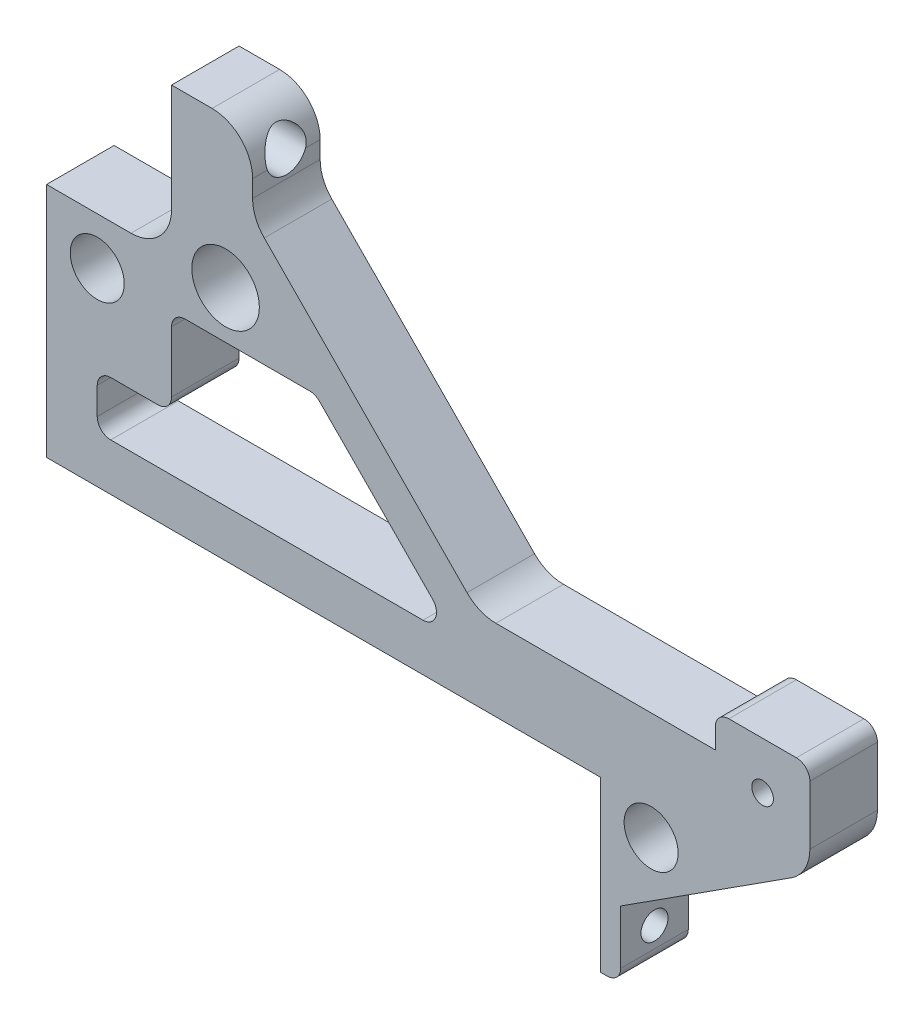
ISO-10303-21;
HEADER;
FILE_DESCRIPTION(('STEP AP214'),'2;1');
FILE_NAME('part.step','',(''),(''),'','','');
FILE_SCHEMA(('AUTOMOTIVE_DESIGN { 1 0 10303 214 1 1 1 1 }'));
ENDSEC;
DATA;
#1=APPLICATION_CONTEXT('core data for automotive mechanical design processes');
#2=APPLICATION_PROTOCOL_DEFINITION('international standard','automotive_design',2000,#1);
#3=PRODUCT_CONTEXT('',#1,'mechanical');
#4=PRODUCT('Part','Part','',(#3));
#5=PRODUCT_RELATED_PRODUCT_CATEGORY('part','',(#4));
#6=PRODUCT_DEFINITION_FORMATION('','',#4);
#7=PRODUCT_DEFINITION_CONTEXT('part definition',#1,'design');
#8=PRODUCT_DEFINITION('design','',#6,#7);
#9=PRODUCT_DEFINITION_SHAPE('','',#8);
#10=(LENGTH_UNIT() NAMED_UNIT(*) SI_UNIT(.MILLI.,.METRE.));
#11=(NAMED_UNIT(*) PLANE_ANGLE_UNIT() SI_UNIT($,.RADIAN.));
#12=(NAMED_UNIT(*) SI_UNIT($,.STERADIAN.) SOLID_ANGLE_UNIT());
#13=UNCERTAINTY_MEASURE_WITH_UNIT(LENGTH_MEASURE(1.E-05),#10,'distance_accuracy_value','');
#14=(GEOMETRIC_REPRESENTATION_CONTEXT(3) GLOBAL_UNCERTAINTY_ASSIGNED_CONTEXT((#13)) GLOBAL_UNIT_ASSIGNED_CONTEXT((#10,
#11,#12)) REPRESENTATION_CONTEXT('',''));
#15=CARTESIAN_POINT('',(0.,0.,0.));
#16=DIRECTION('',(0.,0.,1.));
#17=DIRECTION('',(1.,0.,0.));
#18=AXIS2_PLACEMENT_3D('',#15,#16,#17);
#19=CARTESIAN_POINT('',(-63.5,52.,0.));
#20=DIRECTION('',(-1.,0.,0.));
#21=DIRECTION('',(0.,0.,1.));
#22=AXIS2_PLACEMENT_3D('',#19,#20,#21);
#23=CYLINDRICAL_SURFACE('',#22,3.);
#24=CARTESIAN_POINT('',(-51.5,51.,2.82842712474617));
#25=CARTESIAN_POINT('',(-51.499981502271,51.0806790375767,2.85697161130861));
#26=CARTESIAN_POINT('',(-51.501626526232,51.1625947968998,2.88202984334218));
#27=CARTESIAN_POINT('',(-51.5084108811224,51.3281159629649,2.92503878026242));
#28=CARTESIAN_POINT('',(-51.513549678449,51.4117211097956,2.94299056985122));
#29=CARTESIAN_POINT('',(-51.5274524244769,51.5794243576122,2.97158571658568));
#30=CARTESIAN_POINT('',(-51.5361973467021,51.6635176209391,2.9822666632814));
#31=CARTESIAN_POINT('',(-51.5573379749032,51.8318414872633,2.99647380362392));
#32=CARTESIAN_POINT('',(-51.5697334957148,51.9160720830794,3.00000036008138));
#33=CARTESIAN_POINT('',(-51.5979519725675,52.0830111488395,2.99999964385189));
#34=CARTESIAN_POINT('',(-51.613736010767,52.1657261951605,2.99654900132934));
#35=CARTESIAN_POINT('',(-51.6486394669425,52.329904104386,2.98294517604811));
#36=CARTESIAN_POINT('',(-51.6677603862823,52.4113663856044,2.97278897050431));
#37=CARTESIAN_POINT('',(-51.7297925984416,52.6529462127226,2.93261847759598));
#38=CARTESIAN_POINT('',(-51.7773911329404,52.8103605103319,2.89290176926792));
#39=CARTESIAN_POINT('',(-51.8820551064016,53.1128830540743,2.79050690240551));
#40=CARTESIAN_POINT('',(-51.9390677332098,53.2580534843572,2.72795460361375));
#41=CARTESIAN_POINT('',(-52.0596441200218,53.5348223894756,2.58239796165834));
#42=CARTESIAN_POINT('',(-52.1232118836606,53.6664124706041,2.49938107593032));
#43=CARTESIAN_POINT('',(-52.2602565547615,53.9272868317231,2.30536574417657));
#44=CARTESIAN_POINT('',(-52.3340742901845,54.054888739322,2.19234821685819));
#45=CARTESIAN_POINT('',(-52.4803080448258,54.2896516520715,1.94588435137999));
#46=CARTESIAN_POINT('',(-52.5527237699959,54.3968084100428,1.81243377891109));
#47=CARTESIAN_POINT('',(-52.6810338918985,54.576048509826,1.5448240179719));
#48=CARTESIAN_POINT('',(-52.7378562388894,54.650866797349,1.41294750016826));
#49=CARTESIAN_POINT('',(-52.8403806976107,54.7808477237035,1.13587136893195));
#50=CARTESIAN_POINT('',(-52.8861013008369,54.8360431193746,0.990694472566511));
#51=CARTESIAN_POINT('',(-52.9537303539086,54.9158223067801,0.717192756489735));
#52=CARTESIAN_POINT('',(-52.9784718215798,54.9441691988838,0.590679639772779));
#53=CARTESIAN_POINT('',(-53.0137741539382,54.9842838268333,0.333141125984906));
#54=CARTESIAN_POINT('',(-53.0243492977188,54.9960682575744,0.202120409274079));
#55=CARTESIAN_POINT('',(-53.0298940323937,55.0022714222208,-0.0609780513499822));
#56=CARTESIAN_POINT('',(-53.0248276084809,54.9966500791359,-0.193057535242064));
#57=CARTESIAN_POINT('',(-52.9997314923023,54.9683647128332,-0.453934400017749));
#58=CARTESIAN_POINT('',(-52.9796923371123,54.94568991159,-0.582729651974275));
#59=CARTESIAN_POINT('',(-52.9276862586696,54.8852894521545,-0.831372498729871));
#60=CARTESIAN_POINT('',(-52.8959567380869,54.8478623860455,-0.951344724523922));
#61=CARTESIAN_POINT('',(-52.823566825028,54.7595522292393,-1.18334526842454));
#62=CARTESIAN_POINT('',(-52.7829001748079,54.7086597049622,-1.29536794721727));
#63=CARTESIAN_POINT('',(-52.6749902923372,54.5679639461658,-1.56129787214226));
#64=CARTESIAN_POINT('',(-52.604250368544,54.4711233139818,-1.71008506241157));
#65=CARTESIAN_POINT('',(-52.4575964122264,54.2544332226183,-1.98709164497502));
#66=CARTESIAN_POINT('',(-52.381673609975,54.134544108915,-2.11527488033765));
#67=CARTESIAN_POINT('',(-52.230274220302,53.8728159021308,-2.35026741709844));
#68=CARTESIAN_POINT('',(-52.1548075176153,53.7307920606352,-2.45687766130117));
#69=CARTESIAN_POINT('',(-52.0105056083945,53.4276534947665,-2.6445164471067));
#70=CARTESIAN_POINT('',(-51.9416646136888,53.266555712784,-2.72556746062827));
#71=CARTESIAN_POINT('',(-51.8468058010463,53.0123977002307,-2.82550388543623));
#72=CARTESIAN_POINT('',(-51.816452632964,52.9251114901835,-2.85530577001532));
#73=CARTESIAN_POINT('',(-51.7592452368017,52.7471250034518,-2.90695291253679));
#74=CARTESIAN_POINT('',(-51.7323890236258,52.6564267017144,-2.92880269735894));
#75=CARTESIAN_POINT('',(-51.6826828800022,52.4723815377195,-2.9640567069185));
#76=CARTESIAN_POINT('',(-51.6598307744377,52.3790361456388,-2.97746552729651));
#77=CARTESIAN_POINT('',(-51.6185212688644,52.1905881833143,-2.99543394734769));
#78=CARTESIAN_POINT('',(-51.600060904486,52.0954868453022,-2.99999953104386));
#79=CARTESIAN_POINT('',(-51.5697329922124,51.9160696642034,-3.00000041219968));
#80=CARTESIAN_POINT('',(-51.5573379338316,51.8318414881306,-2.99647384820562));
#81=CARTESIAN_POINT('',(-51.5361991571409,51.6635317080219,-2.98226780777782));
#82=CARTESIAN_POINT('',(-51.5274551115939,51.5794500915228,-2.97158897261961));
#83=CARTESIAN_POINT('',(-51.513552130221,51.4117573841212,-2.94299789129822));
#84=CARTESIAN_POINT('',(-51.5084127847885,51.3281512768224,-2.9250469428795));
#85=CARTESIAN_POINT('',(-51.501626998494,51.1626175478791,-2.8820367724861));
#86=CARTESIAN_POINT('',(-51.4999815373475,51.0806904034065,-2.85697555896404));
#87=CARTESIAN_POINT('',(-51.5,51.,-2.82842712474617));
#88=B_SPLINE_CURVE_WITH_KNOTS('',3,(#24,#25,#26,#27,#28,#29,#30,#31,#32,#33,#34,#35,#36,#37,#38,
#39,#40,#41,#42,#43,#44,#45,#46,#47,#48,#49,#50,#51,#52,#53,#54,#55,#56,#57,#58,#59,#60,#61,#62,
#63,#64,#65,#66,#67,#68,#69,#70,#71,#72,#73,#74,#75,#76,#77,#78,#79,#80,#81,#82,#83,#84,#85,#86,
#87),.UNSPECIFIED.,.F.,.F.,(4,2,2,2,2,2,2,2,2,2,2,2,2,2,2,2,2,2,2,2,2,2,2,2,2,2,2,2,2,2,2,4),
(0.,0.256649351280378,0.513259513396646,0.768532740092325,1.02379302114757,1.27626502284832,
1.52885091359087,2.03371129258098,2.53583010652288,3.03825743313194,3.593262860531,
4.14838345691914,4.63236089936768,5.11552659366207,5.50982447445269,5.90372461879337,
6.29853239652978,6.6935899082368,7.08103113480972,7.46874451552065,8.0390493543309,
8.61034431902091,9.18669181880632,9.76253116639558,10.0534583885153,10.3442197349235,
10.6348226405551,10.9252288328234,11.1804879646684,11.4357242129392,11.6923370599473,
11.9490218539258),.UNSPECIFIED.);
#89=CARTESIAN_POINT('',(-51.5,51.,2.82842712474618));
#90=VERTEX_POINT('',#89);
#91=CARTESIAN_POINT('',(-51.5,51.,-2.82842712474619));
#92=VERTEX_POINT('',#91);
#93=EDGE_CURVE('E477',#90,#92,#88,.T.);
#94=ORIENTED_EDGE('',*,*,#93,.F.);
#95=CARTESIAN_POINT('',(-51.5,52.,0.));
#96=DIRECTION('',(-1.,0.,0.));
#97=DIRECTION('',(0.,0.,1.));
#98=AXIS2_PLACEMENT_3D('',#95,#96,#97);
#99=CIRCLE('',#98,3.);
#100=EDGE_CURVE('E481',#92,#90,#99,.T.);
#101=ORIENTED_EDGE('',*,*,#100,.F.);
#102=EDGE_LOOP('',(#94,#101));
#103=FACE_BOUND('',#102,.T.);
#104=CARTESIAN_POINT('',(-63.5,52.,0.));
#105=DIRECTION('',(-1.,0.,0.));
#106=DIRECTION('',(0.,0.,1.));
#107=AXIS2_PLACEMENT_3D('',#104,#105,#106);
#108=CIRCLE('',#107,3.);
#109=CARTESIAN_POINT('',(-63.5,52.,3.));
#110=VERTEX_POINT('',#109);
#111=EDGE_CURVE('E472',#110,#110,#108,.F.);
#112=ORIENTED_EDGE('',*,*,#111,.F.);
#113=EDGE_LOOP('',(#112));
#114=FACE_BOUND('',#113,.T.);
#115=ADVANCED_FACE('F16',(#103,#114),#23,.F.);
#116=CARTESIAN_POINT('',(0.,-25.,-5.));
#117=DIRECTION('',(0.,-1.,0.));
#118=DIRECTION('',(0.,0.,-1.));
#119=AXIS2_PLACEMENT_3D('',#116,#117,#118);
#120=PLANE('',#119);
#121=DIRECTION('',(1.,0.,0.));
#122=VECTOR('',#121,1.);
#123=CARTESIAN_POINT('',(0.,-25.,-5.));
#124=LINE('',#123,#122);
#125=CARTESIAN_POINT('',(0.,-25.,-5.));
#126=VERTEX_POINT('',#125);
#127=CARTESIAN_POINT('',(1.,-25.,-5.));
#128=VERTEX_POINT('',#127);
#129=EDGE_CURVE('E229',#126,#128,#124,.T.);
#130=ORIENTED_EDGE('',*,*,#129,.T.);
#131=DIRECTION('',(0.,0.,-1.));
#132=VECTOR('',#131,1.);
#133=CARTESIAN_POINT('',(1.,-25.,18.036));
#134=LINE('',#133,#132);
#135=CARTESIAN_POINT('',(1.,-25.,5.));
#136=VERTEX_POINT('',#135);
#137=EDGE_CURVE('E383',#136,#128,#134,.T.);
#138=ORIENTED_EDGE('',*,*,#137,.F.);
#139=DIRECTION('',(1.,0.,0.));
#140=VECTOR('',#139,1.);
#141=CARTESIAN_POINT('',(0.,-25.,5.));
#142=LINE('',#141,#140);
#143=CARTESIAN_POINT('',(0.,-25.,5.));
#144=VERTEX_POINT('',#143);
#145=EDGE_CURVE('E230',#136,#144,#142,.F.);
#146=ORIENTED_EDGE('',*,*,#145,.T.);
#147=DIRECTION('',(0.,0.,1.));
#148=VECTOR('',#147,1.);
#149=CARTESIAN_POINT('',(0.,-25.,-5.));
#150=LINE('',#149,#148);
#151=EDGE_CURVE('E488',#126,#144,#150,.T.);
#152=ORIENTED_EDGE('',*,*,#151,.F.);
#153=EDGE_LOOP('',(#130,#138,#146,#152));
#154=FACE_BOUND('',#153,.T.);
#155=ADVANCED_FACE('F844',(#154),#120,.T.);
#156=CARTESIAN_POINT('',(0.,-20.,0.));
#157=DIRECTION('',(1.,0.,0.));
#158=DIRECTION('',(0.,0.,-1.));
#159=AXIS2_PLACEMENT_3D('',#156,#157,#158);
#160=CYLINDRICAL_SURFACE('',#159,2.);
#161=CARTESIAN_POINT('',(3.,-20.,0.));
#162=DIRECTION('',(1.,0.,0.));
#163=DIRECTION('',(0.,0.,-1.));
#164=AXIS2_PLACEMENT_3D('',#161,#162,#163);
#165=CIRCLE('',#164,2.);
#166=CARTESIAN_POINT('',(3.,-20.,-2.));
#167=VERTEX_POINT('',#166);
#168=EDGE_CURVE('E376',#167,#167,#165,.F.);
#169=ORIENTED_EDGE('',*,*,#168,.F.);
#170=EDGE_LOOP('',(#169));
#171=FACE_BOUND('',#170,.T.);
#172=CARTESIAN_POINT('',(0.,-20.,0.));
#173=DIRECTION('',(1.,0.,0.));
#174=DIRECTION('',(0.,0.,-1.));
#175=AXIS2_PLACEMENT_3D('',#172,#173,#174);
#176=CIRCLE('',#175,2.);
#177=CARTESIAN_POINT('',(0.,-20.,-2.));
#178=VERTEX_POINT('',#177);
#179=EDGE_CURVE('E387',#178,#178,#176,.T.);
#180=ORIENTED_EDGE('',*,*,#179,.F.);
#181=EDGE_LOOP('',(#180));
#182=FACE_BOUND('',#181,.T.);
#183=ADVANCED_FACE('F846',(#171,#182),#160,.F.);
#184=CARTESIAN_POINT('',(-43.02494521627,26.,18.036));
#185=DIRECTION('',(0.,0.,-1.));
#186=DIRECTION('',(-1.,0.,0.));
#187=AXIS2_PLACEMENT_3D('',#184,#185,#186);
#188=CYLINDRICAL_SURFACE('',#187,2.);
#189=DIRECTION('',(0.,0.,1.));
#190=VECTOR('',#189,1.);
#191=CARTESIAN_POINT('',(-41.6002950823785,27.4036993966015,-6.));
#192=LINE('',#191,#190);
#193=CARTESIAN_POINT('',(-41.6002950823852,27.4036993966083,-5.));
#194=VERTEX_POINT('',#193);
#195=CARTESIAN_POINT('',(-41.600295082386,27.4036993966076,5.));
#196=VERTEX_POINT('',#195);
#197=EDGE_CURVE('E232',#194,#196,#192,.T.);
#198=ORIENTED_EDGE('',*,*,#197,.T.);
#199=CARTESIAN_POINT('',(-43.02494521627,26.,5.));
#200=DIRECTION('',(0.,0.,-1.));
#201=DIRECTION('',(-1.,0.,0.));
#202=AXIS2_PLACEMENT_3D('',#199,#200,#201);
#203=CIRCLE('',#202,2.);
#204=CARTESIAN_POINT('',(-43.02494521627,28.,5.));
#205=VERTEX_POINT('',#204);
#206=EDGE_CURVE('E20',#205,#196,#203,.T.);
#207=ORIENTED_EDGE('',*,*,#206,.F.);
#208=DIRECTION('',(0.,0.,1.));
#209=VECTOR('',#208,1.);
#210=CARTESIAN_POINT('',(-43.02494521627,28.,-6.));
#211=LINE('',#210,#209);
#212=CARTESIAN_POINT('',(-43.02494521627,28.,-5.));
#213=VERTEX_POINT('',#212);
#214=EDGE_CURVE('E343',#205,#213,#211,.F.);
#215=ORIENTED_EDGE('',*,*,#214,.T.);
#216=CARTESIAN_POINT('',(-43.02494521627,26.,-5.));
#217=DIRECTION('',(0.,0.,-1.));
#218=DIRECTION('',(-1.,0.,0.));
#219=AXIS2_PLACEMENT_3D('',#216,#217,#218);
#220=CIRCLE('',#219,2.);
#221=EDGE_CURVE('E235',#213,#194,#220,.T.);
#222=ORIENTED_EDGE('',*,*,#221,.T.);
#223=EDGE_LOOP('',(#198,#207,#215,#222));
#224=FACE_BOUND('',#223,.T.);
#225=ADVANCED_FACE('F233',(#224),#188,.F.);
#226=CARTESIAN_POINT('',(0.,0.,-5.));
#227=DIRECTION('',(0.,0.,1.));
#228=DIRECTION('',(1.,0.,0.));
#229=AXIS2_PLACEMENT_3D('',#226,#227,#228);
#230=PLANE('',#229);
#231=CARTESIAN_POINT('',(24.,10.,-5.));
#232=DIRECTION('',(0.,0.,1.));
#233=DIRECTION('',(1.,0.,0.));
#234=AXIS2_PLACEMENT_3D('',#231,#232,#233);
#235=CIRCLE('',#234,1.6);
#236=CARTESIAN_POINT('',(25.6,10.,-5.));
#237=VERTEX_POINT('',#236);
#238=EDGE_CURVE('E315',#237,#237,#235,.T.);
#239=ORIENTED_EDGE('',*,*,#238,.T.);
#240=EDGE_LOOP('',(#239));
#241=FACE_BOUND('',#240,.T.);
#242=CARTESIAN_POINT('',(-55.5,35.,-5.));
#243=DIRECTION('',(0.,0.,1.));
#244=DIRECTION('',(1.,0.,0.));
#245=AXIS2_PLACEMENT_3D('',#242,#243,#244);
#246=CIRCLE('',#245,5.);
#247=CARTESIAN_POINT('',(-50.5,35.,-5.));
#248=VERTEX_POINT('',#247);
#249=EDGE_CURVE('E542',#248,#248,#246,.T.);
#250=ORIENTED_EDGE('',*,*,#249,.T.);
#251=EDGE_LOOP('',(#250));
#252=FACE_BOUND('',#251,.T.);
#253=CARTESIAN_POINT('',(-74.5,28.,-5.));
#254=DIRECTION('',(0.,0.,1.));
#255=DIRECTION('',(1.,0.,0.));
#256=AXIS2_PLACEMENT_3D('',#253,#254,#255);
#257=CIRCLE('',#256,4.);
#258=CARTESIAN_POINT('',(-70.5,28.,-5.));
#259=VERTEX_POINT('',#258);
#260=EDGE_CURVE('E545',#259,#259,#257,.T.);
#261=ORIENTED_EDGE('',*,*,#260,.T.);
#262=EDGE_LOOP('',(#261));
#263=FACE_BOUND('',#262,.T.);
#264=CARTESIAN_POINT('',(7.5,-4.,-5.));
#265=DIRECTION('',(0.,0.,1.));
#266=DIRECTION('',(1.,0.,0.));
#267=AXIS2_PLACEMENT_3D('',#264,#265,#266);
#268=CIRCLE('',#267,4.);
#269=CARTESIAN_POINT('',(11.5,-4.,-5.));
#270=VERTEX_POINT('',#269);
#271=EDGE_CURVE('E321',#270,#270,#268,.T.);
#272=ORIENTED_EDGE('',*,*,#271,.T.);
#273=EDGE_LOOP('',(#272));
#274=FACE_BOUND('',#273,.T.);
#275=CARTESIAN_POINT('',(-72.5,13.,-5.));
#276=DIRECTION('',(0.,0.,-1.));
#277=DIRECTION('',(-1.,0.,0.));
#278=AXIS2_PLACEMENT_3D('',#275,#276,#277);
#279=CIRCLE('',#278,2.);
#280=CARTESIAN_POINT('',(-72.5,15.,-5.));
#281=VERTEX_POINT('',#280);
#282=CARTESIAN_POINT('',(-74.5,13.,-5.));
#283=VERTEX_POINT('',#282);
#284=EDGE_CURVE('E329',#281,#283,#279,.F.);
#285=ORIENTED_EDGE('',*,*,#284,.T.);
#286=DIRECTION('',(0.,1.,0.));
#287=VECTOR('',#286,1.);
#288=CARTESIAN_POINT('',(-74.5,15.,-5.));
#289=LINE('',#288,#287);
#290=CARTESIAN_POINT('',(-74.5,9.,-5.));
#291=VERTEX_POINT('',#290);
#292=EDGE_CURVE('E332',#283,#291,#289,.F.);
#293=ORIENTED_EDGE('',*,*,#292,.T.);
#294=CARTESIAN_POINT('',(-72.5,9.,-5.));
#295=DIRECTION('',(0.,0.,-1.));
#296=DIRECTION('',(-1.,0.,0.));
#297=AXIS2_PLACEMENT_3D('',#294,#295,#296);
#298=CIRCLE('',#297,2.);
#299=CARTESIAN_POINT('',(-72.5,7.,-5.));
#300=VERTEX_POINT('',#299);
#301=EDGE_CURVE('E335',#291,#300,#298,.F.);
#302=ORIENTED_EDGE('',*,*,#301,.T.);
#303=DIRECTION('',(1.,0.,0.));
#304=VECTOR('',#303,1.);
#305=CARTESIAN_POINT('',(-74.5,7.,-5.));
#306=LINE('',#305,#304);
#307=CARTESIAN_POINT('',(-26.27494521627,7.,-5.));
#308=VERTEX_POINT('',#307);
#309=EDGE_CURVE('E336',#300,#308,#306,.T.);
#310=ORIENTED_EDGE('',*,*,#309,.T.);
#311=CARTESIAN_POINT('',(-26.27494521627,9.,-5.));
#312=DIRECTION('',(0.,0.,-1.));
#313=DIRECTION('',(-1.,0.,0.));
#314=AXIS2_PLACEMENT_3D('',#311,#312,#313);
#315=CIRCLE('',#314,2.);
#316=CARTESIAN_POINT('',(-24.850295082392,10.4036993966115,-5.));
#317=VERTEX_POINT('',#316);
#318=EDGE_CURVE('E339',#308,#317,#315,.F.);
#319=ORIENTED_EDGE('',*,*,#318,.T.);
#320=DIRECTION('',(-0.701849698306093,0.712325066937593,0.));
#321=VECTOR('',#320,1.);
#322=CARTESIAN_POINT('',(-21.49665008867,7.,-5.));
#323=LINE('',#322,#321);
#324=EDGE_CURVE('E238',#317,#194,#323,.T.);
#325=ORIENTED_EDGE('',*,*,#324,.T.);
#326=ORIENTED_EDGE('',*,*,#221,.F.);
#327=DIRECTION('',(1.,0.,0.));
#328=VECTOR('',#327,1.);
#329=CARTESIAN_POINT('',(-42.18782655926,28.,-5.));
#330=LINE('',#329,#328);
#331=CARTESIAN_POINT('',(-61.5,28.,-5.));
#332=VERTEX_POINT('',#331);
#333=EDGE_CURVE('E239',#213,#332,#330,.F.);
#334=ORIENTED_EDGE('',*,*,#333,.T.);
#335=CARTESIAN_POINT('',(-61.5,26.,-5.));
#336=DIRECTION('',(0.,0.,-1.));
#337=DIRECTION('',(-1.,0.,0.));
#338=AXIS2_PLACEMENT_3D('',#335,#336,#337);
#339=CIRCLE('',#338,2.);
#340=CARTESIAN_POINT('',(-63.5,26.,-5.));
#341=VERTEX_POINT('',#340);
#342=EDGE_CURVE('E344',#332,#341,#339,.F.);
#343=ORIENTED_EDGE('',*,*,#342,.T.);
#344=DIRECTION('',(0.,1.,0.));
#345=VECTOR('',#344,1.);
#346=CARTESIAN_POINT('',(-63.5,28.,-5.));
#347=LINE('',#346,#345);
#348=CARTESIAN_POINT('',(-63.5,17.,-5.));
#349=VERTEX_POINT('',#348);
#350=EDGE_CURVE('E348',#341,#349,#347,.F.);
#351=ORIENTED_EDGE('',*,*,#350,.T.);
#352=CARTESIAN_POINT('',(-65.5,17.,-5.));
#353=DIRECTION('',(0.,0.,1.));
#354=DIRECTION('',(1.,0.,0.));
#355=AXIS2_PLACEMENT_3D('',#352,#353,#354);
#356=CIRCLE('',#355,2.);
#357=CARTESIAN_POINT('',(-65.5,15.,-5.));
#358=VERTEX_POINT('',#357);
#359=EDGE_CURVE('E322',#358,#349,#356,.T.);
#360=ORIENTED_EDGE('',*,*,#359,.F.);
#361=DIRECTION('',(1.,0.,0.));
#362=VECTOR('',#361,1.);
#363=CARTESIAN_POINT('',(-63.5,15.,-5.));
#364=LINE('',#363,#362);
#365=EDGE_CURVE('E326',#358,#281,#364,.F.);
#366=ORIENTED_EDGE('',*,*,#365,.T.);
#367=EDGE_LOOP('',(#285,#293,#302,#310,#319,#325,#326,#334,#343,#351,#360,#366));
#368=FACE_BOUND('',#367,.T.);
#369=CARTESIAN_POINT('',(29.,15.,-5.));
#370=DIRECTION('',(0.,0.,-1.));
#371=DIRECTION('',(-1.,0.,0.));
#372=AXIS2_PLACEMENT_3D('',#369,#370,#371);
#373=CIRCLE('',#372,2.);
#374=CARTESIAN_POINT('',(31.,15.,-5.));
#375=VERTEX_POINT('',#374);
#376=CARTESIAN_POINT('',(29.,17.,-5.));
#377=VERTEX_POINT('',#376);
#378=EDGE_CURVE('E360',#375,#377,#373,.F.);
#379=ORIENTED_EDGE('',*,*,#378,.F.);
#380=DIRECTION('',(0.,1.,0.));
#381=VECTOR('',#380,1.);
#382=CARTESIAN_POINT('',(31.,3.,-5.));
#383=LINE('',#382,#381);
#384=CARTESIAN_POINT('',(31.,6.275707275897,-5.));
#385=VERTEX_POINT('',#384);
#386=EDGE_CURVE('E364',#385,#375,#383,.T.);
#387=ORIENTED_EDGE('',*,*,#386,.F.);
#388=CARTESIAN_POINT('',(25.,6.275707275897,-5.));
#389=DIRECTION('',(0.,0.,-1.));
#390=DIRECTION('',(-1.,0.,0.));
#391=AXIS2_PLACEMENT_3D('',#388,#389,#390);
#392=CIRCLE('',#391,6.);
#393=CARTESIAN_POINT('',(28.2445455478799,1.22863642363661,-5.));
#394=VERTEX_POINT('',#393);
#395=EDGE_CURVE('E368',#394,#385,#392,.F.);
#396=ORIENTED_EDGE('',*,*,#395,.F.);
#397=DIRECTION('',(0.841178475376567,0.540757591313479,0.));
#398=VECTOR('',#397,1.);
#399=CARTESIAN_POINT('',(3.,-15.,-5.));
#400=LINE('',#399,#398);
#401=CARTESIAN_POINT('',(3.,-15.,-5.));
#402=VERTEX_POINT('',#401);
#403=EDGE_CURVE('E372',#402,#394,#400,.T.);
#404=ORIENTED_EDGE('',*,*,#403,.F.);
#405=DIRECTION('',(0.,1.,0.));
#406=VECTOR('',#405,1.);
#407=CARTESIAN_POINT('',(3.,-25.,-5.));
#408=LINE('',#407,#406);
#409=CARTESIAN_POINT('',(3.,-23.,-5.));
#410=VERTEX_POINT('',#409);
#411=EDGE_CURVE('E382',#410,#402,#408,.T.);
#412=ORIENTED_EDGE('',*,*,#411,.F.);
#413=CARTESIAN_POINT('',(1.,-23.,-5.));
#414=DIRECTION('',(0.,0.,-1.));
#415=DIRECTION('',(-1.,0.,0.));
#416=AXIS2_PLACEMENT_3D('',#413,#414,#415);
#417=CIRCLE('',#416,2.);
#418=EDGE_CURVE('E386',#128,#410,#417,.F.);
#419=ORIENTED_EDGE('',*,*,#418,.F.);
#420=ORIENTED_EDGE('',*,*,#129,.F.);
#421=DIRECTION('',(0.,1.,0.));
#422=VECTOR('',#421,1.);
#423=CARTESIAN_POINT('',(0.,0.,-5.));
#424=LINE('',#423,#422);
#425=CARTESIAN_POINT('',(0.,0.,-5.));
#426=VERTEX_POINT('',#425);
#427=EDGE_CURVE('E495',#426,#126,#424,.F.);
#428=ORIENTED_EDGE('',*,*,#427,.F.);
#429=DIRECTION('',(1.,0.,0.));
#430=VECTOR('',#429,1.);
#431=CARTESIAN_POINT('',(-82.,0.,-5.));
#432=LINE('',#431,#430);
#433=CARTESIAN_POINT('',(-82.,0.,-5.));
#434=VERTEX_POINT('',#433);
#435=EDGE_CURVE('E492',#434,#426,#432,.T.);
#436=ORIENTED_EDGE('',*,*,#435,.F.);
#437=DIRECTION('',(0.,1.,0.));
#438=VECTOR('',#437,1.);
#439=CARTESIAN_POINT('',(-82.,35.,-5.));
#440=LINE('',#439,#438);
#441=CARTESIAN_POINT('',(-82.,35.,-5.));
#442=VERTEX_POINT('',#441);
#443=EDGE_CURVE('E399',#442,#434,#440,.F.);
#444=ORIENTED_EDGE('',*,*,#443,.F.);
#445=DIRECTION('',(1.,0.,0.));
#446=VECTOR('',#445,1.);
#447=CARTESIAN_POINT('',(-63.5,35.,-5.));
#448=LINE('',#447,#446);
#449=CARTESIAN_POINT('',(-69.5,35.,-5.));
#450=VERTEX_POINT('',#449);
#451=EDGE_CURVE('E392',#450,#442,#448,.F.);
#452=ORIENTED_EDGE('',*,*,#451,.F.);
#453=CARTESIAN_POINT('',(-69.5,41.,-5.));
#454=DIRECTION('',(0.,0.,1.));
#455=DIRECTION('',(1.,0.,0.));
#456=AXIS2_PLACEMENT_3D('',#453,#454,#455);
#457=CIRCLE('',#456,6.);
#458=CARTESIAN_POINT('',(-63.5,41.,-5.));
#459=VERTEX_POINT('',#458);
#460=EDGE_CURVE('E404',#450,#459,#457,.T.);
#461=ORIENTED_EDGE('',*,*,#460,.T.);
#462=DIRECTION('',(0.,1.,0.));
#463=VECTOR('',#462,1.);
#464=CARTESIAN_POINT('',(-63.5,57.,-5.));
#465=LINE('',#464,#463);
#466=CARTESIAN_POINT('',(-63.5,57.,-5.));
#467=VERTEX_POINT('',#466);
#468=EDGE_CURVE('E408',#467,#459,#465,.F.);
#469=ORIENTED_EDGE('',*,*,#468,.F.);
#470=DIRECTION('',(1.,0.,0.));
#471=VECTOR('',#470,1.);
#472=CARTESIAN_POINT('',(-51.5,57.,-5.));
#473=LINE('',#472,#471);
#474=CARTESIAN_POINT('',(-57.5,57.,-5.));
#475=VERTEX_POINT('',#474);
#476=EDGE_CURVE('E414',#475,#467,#473,.F.);
#477=ORIENTED_EDGE('',*,*,#476,.F.);
#478=CARTESIAN_POINT('',(-57.5,51.,-5.));
#479=DIRECTION('',(0.,0.,-1.));
#480=DIRECTION('',(-1.,0.,0.));
#481=AXIS2_PLACEMENT_3D('',#478,#479,#480);
#482=CIRCLE('',#481,6.);
#483=CARTESIAN_POINT('',(-51.5,51.,-5.));
#484=VERTEX_POINT('',#483);
#485=EDGE_CURVE('E580',#484,#475,#482,.F.);
#486=ORIENTED_EDGE('',*,*,#485,.F.);
#487=DIRECTION('',(0.,1.,0.));
#488=VECTOR('',#487,1.);
#489=CARTESIAN_POINT('',(-51.5,46.,-5.));
#490=LINE('',#489,#488);
#491=CARTESIAN_POINT('',(-51.5,48.45928665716,-5.));
#492=VERTEX_POINT('',#491);
#493=EDGE_CURVE('E418',#492,#484,#490,.T.);
#494=ORIENTED_EDGE('',*,*,#493,.F.);
#495=CARTESIAN_POINT('',(-45.5,48.45928665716,-5.));
#496=DIRECTION('',(0.,0.,1.));
#497=DIRECTION('',(1.,0.,0.));
#498=AXIS2_PLACEMENT_3D('',#495,#496,#497);
#499=CIRCLE('',#498,6.);
#500=CARTESIAN_POINT('',(-49.7739504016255,44.2481884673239,-5.));
#501=VERTEX_POINT('',#500);
#502=EDGE_CURVE('E421',#492,#501,#499,.T.);
#503=ORIENTED_EDGE('',*,*,#502,.T.);
#504=DIRECTION('',(-0.701849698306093,0.712325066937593,0.));
#505=VECTOR('',#504,1.);
#506=CARTESIAN_POINT('',(-18.,12.,-5.));
#507=LINE('',#506,#505);
#508=CARTESIAN_POINT('',(-19.7625944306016,13.7889018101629,-5.));
#509=VERTEX_POINT('',#508);
#510=EDGE_CURVE('E425',#509,#501,#507,.T.);
#511=ORIENTED_EDGE('',*,*,#510,.F.);
#512=CARTESIAN_POINT('',(-15.48864402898,18.,-5.));
#513=DIRECTION('',(0.,0.,1.));
#514=DIRECTION('',(1.,0.,0.));
#515=AXIS2_PLACEMENT_3D('',#512,#513,#514);
#516=CIRCLE('',#515,6.);
#517=CARTESIAN_POINT('',(-15.48864402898,12.,-5.));
#518=VERTEX_POINT('',#517);
#519=EDGE_CURVE('E428',#509,#518,#516,.T.);
#520=ORIENTED_EDGE('',*,*,#519,.T.);
#521=DIRECTION('',(1.,0.,0.));
#522=VECTOR('',#521,1.);
#523=CARTESIAN_POINT('',(17.,12.,-5.));
#524=LINE('',#523,#522);
#525=CARTESIAN_POINT('',(17.,12.,-5.));
#526=VERTEX_POINT('',#525);
#527=EDGE_CURVE('E432',#526,#518,#524,.F.);
#528=ORIENTED_EDGE('',*,*,#527,.F.);
#529=DIRECTION('',(0.,1.,0.));
#530=VECTOR('',#529,1.);
#531=CARTESIAN_POINT('',(17.,17.,-5.));
#532=LINE('',#531,#530);
#533=CARTESIAN_POINT('',(17.,15.,-5.));
#534=VERTEX_POINT('',#533);
#535=EDGE_CURVE('E433',#534,#526,#532,.F.);
#536=ORIENTED_EDGE('',*,*,#535,.F.);
#537=CARTESIAN_POINT('',(19.,15.,-5.));
#538=DIRECTION('',(0.,0.,-1.));
#539=DIRECTION('',(-1.,0.,0.));
#540=AXIS2_PLACEMENT_3D('',#537,#538,#539);
#541=CIRCLE('',#540,2.);
#542=CARTESIAN_POINT('',(19.,17.,-5.));
#543=VERTEX_POINT('',#542);
#544=EDGE_CURVE('E356',#543,#534,#541,.F.);
#545=ORIENTED_EDGE('',*,*,#544,.F.);
#546=DIRECTION('',(1.,0.,0.));
#547=VECTOR('',#546,1.);
#548=CARTESIAN_POINT('',(31.,17.,-5.));
#549=LINE('',#548,#547);
#550=EDGE_CURVE('E353',#377,#543,#549,.F.);
#551=ORIENTED_EDGE('',*,*,#550,.F.);
#552=EDGE_LOOP('',(#379,#387,#396,#404,#412,#419,#420,#428,#436,#444,#452,#461,#469,#477,#486,
#494,#503,#511,#520,#528,#536,#545,#551));
#553=FACE_BOUND('',#552,.T.);
#554=ADVANCED_FACE('F716',(#241,#252,#263,#274,#368,#553),#230,.F.);
#555=CARTESIAN_POINT('',(17.,17.,-5.));
#556=DIRECTION('',(-1.,0.,0.));
#557=DIRECTION('',(0.,0.,1.));
#558=AXIS2_PLACEMENT_3D('',#555,#556,#557);
#559=PLANE('',#558);
#560=DIRECTION('',(0.,1.,0.));
#561=VECTOR('',#560,1.);
#562=CARTESIAN_POINT('',(17.,0.,5.));
#563=LINE('',#562,#561);
#564=CARTESIAN_POINT('',(17.,15.,5.));
#565=VERTEX_POINT('',#564);
#566=CARTESIAN_POINT('',(17.,12.,5.));
#567=VERTEX_POINT('',#566);
#568=EDGE_CURVE('E310',#565,#567,#563,.F.);
#569=ORIENTED_EDGE('',*,*,#568,.F.);
#570=DIRECTION('',(0.,0.,-1.));
#571=VECTOR('',#570,1.);
#572=CARTESIAN_POINT('',(17.,15.,18.036));
#573=LINE('',#572,#571);
#574=EDGE_CURVE('E349',#534,#565,#573,.F.);
#575=ORIENTED_EDGE('',*,*,#574,.F.);
#576=ORIENTED_EDGE('',*,*,#535,.T.);
#577=DIRECTION('',(0.,0.,1.));
#578=VECTOR('',#577,1.);
#579=CARTESIAN_POINT('',(17.,12.,-5.));
#580=LINE('',#579,#578);
#581=EDGE_CURVE('E429',#567,#526,#580,.F.);
#582=ORIENTED_EDGE('',*,*,#581,.F.);
#583=EDGE_LOOP('',(#569,#575,#576,#582));
#584=FACE_BOUND('',#583,.T.);
#585=ADVANCED_FACE('F719',(#584),#559,.T.);
#586=CARTESIAN_POINT('',(17.,12.,-5.));
#587=DIRECTION('',(0.,1.,0.));
#588=DIRECTION('',(0.,0.,1.));
#589=AXIS2_PLACEMENT_3D('',#586,#587,#588);
#590=PLANE('',#589);
#591=ORIENTED_EDGE('',*,*,#527,.T.);
#592=DIRECTION('',(0.,0.,1.));
#593=VECTOR('',#592,1.);
#594=CARTESIAN_POINT('',(-15.48864402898,12.,-18.036));
#595=LINE('',#594,#593);
#596=CARTESIAN_POINT('',(-15.48864402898,12.,5.));
#597=VERTEX_POINT('',#596);
#598=EDGE_CURVE('E426',#518,#597,#595,.T.);
#599=ORIENTED_EDGE('',*,*,#598,.T.);
#600=DIRECTION('',(1.,0.,0.));
#601=VECTOR('',#600,1.);
#602=CARTESIAN_POINT('',(0.,12.,5.));
#603=LINE('',#602,#601);
#604=EDGE_CURVE('E307',#567,#597,#603,.F.);
#605=ORIENTED_EDGE('',*,*,#604,.F.);
#606=ORIENTED_EDGE('',*,*,#581,.T.);
#607=EDGE_LOOP('',(#591,#599,#605,#606));
#608=FACE_BOUND('',#607,.T.);
#609=ADVANCED_FACE('F835',(#608),#590,.T.);
#610=CARTESIAN_POINT('',(-15.48864402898,18.,-18.036));
#611=DIRECTION('',(0.,0.,1.));
#612=DIRECTION('',(1.,0.,0.));
#613=AXIS2_PLACEMENT_3D('',#610,#611,#612);
#614=CYLINDRICAL_SURFACE('',#613,6.);
#615=ORIENTED_EDGE('',*,*,#598,.F.);
#616=ORIENTED_EDGE('',*,*,#519,.F.);
#617=DIRECTION('',(0.,0.,1.));
#618=VECTOR('',#617,1.);
#619=CARTESIAN_POINT('',(-19.7625944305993,13.7889018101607,-5.));
#620=LINE('',#619,#618);
#621=CARTESIAN_POINT('',(-19.762594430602,13.7889018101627,5.));
#622=VERTEX_POINT('',#621);
#623=EDGE_CURVE('E422',#622,#509,#620,.F.);
#624=ORIENTED_EDGE('',*,*,#623,.F.);
#625=CARTESIAN_POINT('',(-15.48864402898,18.,5.));
#626=DIRECTION('',(0.,0.,1.));
#627=DIRECTION('',(1.,0.,0.));
#628=AXIS2_PLACEMENT_3D('',#625,#626,#627);
#629=CIRCLE('',#628,6.);
#630=EDGE_CURVE('E306',#597,#622,#629,.F.);
#631=ORIENTED_EDGE('',*,*,#630,.F.);
#632=EDGE_LOOP('',(#615,#616,#624,#631));
#633=FACE_BOUND('',#632,.T.);
#634=ADVANCED_FACE('F832',(#633),#614,.F.);
#635=CARTESIAN_POINT('',(-18.,12.,-5.));
#636=DIRECTION('',(0.712325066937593,0.701849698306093,0.));
#637=DIRECTION('',(-0.701849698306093,0.712325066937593,0.));
#638=AXIS2_PLACEMENT_3D('',#635,#636,#637);
#639=PLANE('',#638);
#640=ORIENTED_EDGE('',*,*,#510,.T.);
#641=DIRECTION('',(0.,0.,1.));
#642=VECTOR('',#641,1.);
#643=CARTESIAN_POINT('',(-49.773950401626,44.2481884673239,-18.036));
#644=LINE('',#643,#642);
#645=CARTESIAN_POINT('',(-49.7739504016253,44.2481884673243,5.));
#646=VERTEX_POINT('',#645);
#647=EDGE_CURVE('E419',#501,#646,#644,.T.);
#648=ORIENTED_EDGE('',*,*,#647,.T.);
#649=DIRECTION('',(-0.701849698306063,0.712325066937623,0.));
#650=VECTOR('',#649,1.);
#651=CARTESIAN_POINT('',(-19.7625944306,13.78890181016,5.));
#652=LINE('',#651,#650);
#653=EDGE_CURVE('E303',#622,#646,#652,.T.);
#654=ORIENTED_EDGE('',*,*,#653,.F.);
#655=ORIENTED_EDGE('',*,*,#623,.T.);
#656=EDGE_LOOP('',(#640,#648,#654,#655));
#657=FACE_BOUND('',#656,.T.);
#658=ADVANCED_FACE('F828',(#657),#639,.T.);
#659=CARTESIAN_POINT('',(-45.5,48.45928665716,-18.036));
#660=DIRECTION('',(0.,0.,1.));
#661=DIRECTION('',(1.,0.,0.));
#662=AXIS2_PLACEMENT_3D('',#659,#660,#661);
#663=CYLINDRICAL_SURFACE('',#662,6.);
#664=ORIENTED_EDGE('',*,*,#647,.F.);
#665=ORIENTED_EDGE('',*,*,#502,.F.);
#666=DIRECTION('',(0.,0.,-1.));
#667=VECTOR('',#666,1.);
#668=CARTESIAN_POINT('',(-51.5,48.45928665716,-5.));
#669=LINE('',#668,#667);
#670=CARTESIAN_POINT('',(-51.5,48.45928665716,5.));
#671=VERTEX_POINT('',#670);
#672=EDGE_CURVE('E415',#671,#492,#669,.T.);
#673=ORIENTED_EDGE('',*,*,#672,.F.);
#674=CARTESIAN_POINT('',(-45.5,48.45928665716,5.));
#675=DIRECTION('',(0.,0.,1.));
#676=DIRECTION('',(1.,0.,0.));
#677=AXIS2_PLACEMENT_3D('',#674,#675,#676);
#678=CIRCLE('',#677,6.);
#679=EDGE_CURVE('E302',#646,#671,#678,.F.);
#680=ORIENTED_EDGE('',*,*,#679,.F.);
#681=EDGE_LOOP('',(#664,#665,#673,#680));
#682=FACE_BOUND('',#681,.T.);
#683=ADVANCED_FACE('F819',(#682),#663,.F.);
#684=CARTESIAN_POINT('',(-51.5,46.,-5.));
#685=DIRECTION('',(1.,0.,0.));
#686=DIRECTION('',(0.,0.,-1.));
#687=AXIS2_PLACEMENT_3D('',#684,#685,#686);
#688=PLANE('',#687);
#689=DIRECTION('',(0.,0.,-1.));
#690=VECTOR('',#689,1.);
#691=CARTESIAN_POINT('',(-51.5,51.,18.036));
#692=LINE('',#691,#690);
#693=EDGE_CURVE('E783',#92,#484,#692,.T.);
#694=ORIENTED_EDGE('',*,*,#693,.F.);
#695=ORIENTED_EDGE('',*,*,#100,.T.);
#696=DIRECTION('',(0.,0.,-1.));
#697=VECTOR('',#696,1.);
#698=CARTESIAN_POINT('',(-51.5,51.,18.036));
#699=LINE('',#698,#697);
#700=CARTESIAN_POINT('',(-51.5,51.,5.));
#701=VERTEX_POINT('',#700);
#702=EDGE_CURVE('E579',#701,#90,#699,.T.);
#703=ORIENTED_EDGE('',*,*,#702,.F.);
#704=DIRECTION('',(0.,1.,0.));
#705=VECTOR('',#704,1.);
#706=CARTESIAN_POINT('',(-51.5,0.,5.));
#707=LINE('',#706,#705);
#708=EDGE_CURVE('E299',#671,#701,#707,.T.);
#709=ORIENTED_EDGE('',*,*,#708,.F.);
#710=ORIENTED_EDGE('',*,*,#672,.T.);
#711=ORIENTED_EDGE('',*,*,#493,.T.);
#712=EDGE_LOOP('',(#694,#695,#703,#709,#710,#711));
#713=FACE_BOUND('',#712,.T.);
#714=ADVANCED_FACE('F590',(#713),#688,.T.);
#715=CARTESIAN_POINT('',(-57.5,51.,18.036));
#716=DIRECTION('',(0.,0.,-1.));
#717=DIRECTION('',(-1.,0.,0.));
#718=AXIS2_PLACEMENT_3D('',#715,#716,#717);
#719=CYLINDRICAL_SURFACE('',#718,6.);
#720=ORIENTED_EDGE('',*,*,#702,.T.);
#721=ORIENTED_EDGE('',*,*,#93,.T.);
#722=ORIENTED_EDGE('',*,*,#693,.T.);
#723=ORIENTED_EDGE('',*,*,#485,.T.);
#724=DIRECTION('',(0.,0.,1.));
#725=VECTOR('',#724,1.);
#726=CARTESIAN_POINT('',(-57.5,57.,-5.));
#727=LINE('',#726,#725);
#728=CARTESIAN_POINT('',(-57.5,57.,5.));
#729=VERTEX_POINT('',#728);
#730=EDGE_CURVE('E409',#729,#475,#727,.F.);
#731=ORIENTED_EDGE('',*,*,#730,.F.);
#732=CARTESIAN_POINT('',(-57.5,51.,5.));
#733=DIRECTION('',(0.,0.,-1.));
#734=DIRECTION('',(-1.,0.,0.));
#735=AXIS2_PLACEMENT_3D('',#732,#733,#734);
#736=CIRCLE('',#735,6.);
#737=EDGE_CURVE('E296',#701,#729,#736,.F.);
#738=ORIENTED_EDGE('',*,*,#737,.F.);
#739=EDGE_LOOP('',(#720,#721,#722,#723,#731,#738));
#740=FACE_BOUND('',#739,.T.);
#741=ADVANCED_FACE('F584',(#740),#719,.T.);
#742=CARTESIAN_POINT('',(-51.5,57.,-5.));
#743=DIRECTION('',(0.,1.,0.));
#744=DIRECTION('',(0.,0.,1.));
#745=AXIS2_PLACEMENT_3D('',#742,#743,#744);
#746=PLANE('',#745);
#747=DIRECTION('',(1.,0.,0.));
#748=VECTOR('',#747,1.);
#749=CARTESIAN_POINT('',(0.,57.,5.));
#750=LINE('',#749,#748);
#751=CARTESIAN_POINT('',(-63.5,57.,5.));
#752=VERTEX_POINT('',#751);
#753=EDGE_CURVE('E291',#729,#752,#750,.F.);
#754=ORIENTED_EDGE('',*,*,#753,.F.);
#755=ORIENTED_EDGE('',*,*,#730,.T.);
#756=ORIENTED_EDGE('',*,*,#476,.T.);
#757=DIRECTION('',(0.,0.,1.));
#758=VECTOR('',#757,1.);
#759=CARTESIAN_POINT('',(-63.5,57.,-5.));
#760=LINE('',#759,#758);
#761=EDGE_CURVE('E405',#752,#467,#760,.F.);
#762=ORIENTED_EDGE('',*,*,#761,.F.);
#763=EDGE_LOOP('',(#754,#755,#756,#762));
#764=FACE_BOUND('',#763,.T.);
#765=ADVANCED_FACE('F589',(#764),#746,.T.);
#766=CARTESIAN_POINT('',(-63.5,57.,-5.));
#767=DIRECTION('',(-1.,0.,0.));
#768=DIRECTION('',(0.,0.,1.));
#769=AXIS2_PLACEMENT_3D('',#766,#767,#768);
#770=PLANE('',#769);
#771=ORIENTED_EDGE('',*,*,#111,.T.);
#772=EDGE_LOOP('',(#771));
#773=FACE_BOUND('',#772,.T.);
#774=ORIENTED_EDGE('',*,*,#468,.T.);
#775=DIRECTION('',(0.,0.,1.));
#776=VECTOR('',#775,1.);
#777=CARTESIAN_POINT('',(-63.5,41.,-18.036));
#778=LINE('',#777,#776);
#779=CARTESIAN_POINT('',(-63.5,41.,5.));
#780=VERTEX_POINT('',#779);
#781=EDGE_CURVE('E402',#459,#780,#778,.T.);
#782=ORIENTED_EDGE('',*,*,#781,.T.);
#783=DIRECTION('',(0.,1.,0.));
#784=VECTOR('',#783,1.);
#785=CARTESIAN_POINT('',(-63.5,0.,5.));
#786=LINE('',#785,#784);
#787=EDGE_CURVE('E288',#752,#780,#786,.F.);
#788=ORIENTED_EDGE('',*,*,#787,.F.);
#789=ORIENTED_EDGE('',*,*,#761,.T.);
#790=EDGE_LOOP('',(#774,#782,#788,#789));
#791=FACE_BOUND('',#790,.T.);
#792=ADVANCED_FACE('F595',(#773,#791),#770,.T.);
#793=CARTESIAN_POINT('',(-69.5,41.,-18.036));
#794=DIRECTION('',(0.,0.,1.));
#795=DIRECTION('',(1.,0.,0.));
#796=AXIS2_PLACEMENT_3D('',#793,#794,#795);
#797=CYLINDRICAL_SURFACE('',#796,6.);
#798=ORIENTED_EDGE('',*,*,#781,.F.);
#799=ORIENTED_EDGE('',*,*,#460,.F.);
#800=DIRECTION('',(0.,0.,1.));
#801=VECTOR('',#800,1.);
#802=CARTESIAN_POINT('',(-69.5,35.,-5.));
#803=LINE('',#802,#801);
#804=CARTESIAN_POINT('',(-69.5,35.,5.));
#805=VERTEX_POINT('',#804);
#806=EDGE_CURVE('E388',#805,#450,#803,.F.);
#807=ORIENTED_EDGE('',*,*,#806,.F.);
#808=CARTESIAN_POINT('',(-69.5,41.,5.));
#809=DIRECTION('',(0.,0.,1.));
#810=DIRECTION('',(1.,0.,0.));
#811=AXIS2_PLACEMENT_3D('',#808,#809,#810);
#812=CIRCLE('',#811,6.);
#813=EDGE_CURVE('E285',#780,#805,#812,.F.);
#814=ORIENTED_EDGE('',*,*,#813,.F.);
#815=EDGE_LOOP('',(#798,#799,#807,#814));
#816=FACE_BOUND('',#815,.T.);
#817=ADVANCED_FACE('F599',(#816),#797,.F.);
#818=CARTESIAN_POINT('',(-63.5,35.,-5.));
#819=DIRECTION('',(0.,1.,0.));
#820=DIRECTION('',(0.,0.,1.));
#821=AXIS2_PLACEMENT_3D('',#818,#819,#820);
#822=PLANE('',#821);
#823=DIRECTION('',(1.,0.,0.));
#824=VECTOR('',#823,1.);
#825=CARTESIAN_POINT('',(0.,35.,5.));
#826=LINE('',#825,#824);
#827=CARTESIAN_POINT('',(-82.,35.,5.));
#828=VERTEX_POINT('',#827);
#829=EDGE_CURVE('E282',#805,#828,#826,.F.);
#830=ORIENTED_EDGE('',*,*,#829,.F.);
#831=ORIENTED_EDGE('',*,*,#806,.T.);
#832=ORIENTED_EDGE('',*,*,#451,.T.);
#833=DIRECTION('',(0.,0.,1.));
#834=VECTOR('',#833,1.);
#835=CARTESIAN_POINT('',(-82.,35.,-5.));
#836=LINE('',#835,#834);
#837=EDGE_CURVE('E391',#828,#442,#836,.F.);
#838=ORIENTED_EDGE('',*,*,#837,.F.);
#839=EDGE_LOOP('',(#830,#831,#832,#838));
#840=FACE_BOUND('',#839,.T.);
#841=ADVANCED_FACE('F603',(#840),#822,.T.);
#842=CARTESIAN_POINT('',(-82.,35.,-5.));
#843=DIRECTION('',(-1.,0.,0.));
#844=DIRECTION('',(0.,0.,1.));
#845=AXIS2_PLACEMENT_3D('',#842,#843,#844);
#846=PLANE('',#845);
#847=ORIENTED_EDGE('',*,*,#837,.T.);
#848=ORIENTED_EDGE('',*,*,#443,.T.);
#849=DIRECTION('',(0.,0.,-1.));
#850=VECTOR('',#849,1.);
#851=CARTESIAN_POINT('',(-82.,0.,-5.));
#852=LINE('',#851,#850);
#853=CARTESIAN_POINT('',(-82.,0.,5.));
#854=VERTEX_POINT('',#853);
#855=EDGE_CURVE('E467',#854,#434,#852,.T.);
#856=ORIENTED_EDGE('',*,*,#855,.F.);
#857=DIRECTION('',(0.,1.,0.));
#858=VECTOR('',#857,1.);
#859=CARTESIAN_POINT('',(-82.,0.,5.));
#860=LINE('',#859,#858);
#861=EDGE_CURVE('E281',#828,#854,#860,.F.);
#862=ORIENTED_EDGE('',*,*,#861,.F.);
#863=EDGE_LOOP('',(#847,#848,#856,#862));
#864=FACE_BOUND('',#863,.T.);
#865=ADVANCED_FACE('F607',(#864),#846,.T.);
#866=CARTESIAN_POINT('',(-82.,0.,-5.));
#867=DIRECTION('',(0.,-1.,0.));
#868=DIRECTION('',(0.,0.,-1.));
#869=AXIS2_PLACEMENT_3D('',#866,#867,#868);
#870=PLANE('',#869);
#871=ORIENTED_EDGE('',*,*,#855,.T.);
#872=ORIENTED_EDGE('',*,*,#435,.T.);
#873=DIRECTION('',(0.,0.,1.));
#874=VECTOR('',#873,1.);
#875=CARTESIAN_POINT('',(0.,0.,-5.));
#876=LINE('',#875,#874);
#877=CARTESIAN_POINT('',(0.,0.,5.));
#878=VERTEX_POINT('',#877);
#879=EDGE_CURVE('E491',#878,#426,#876,.F.);
#880=ORIENTED_EDGE('',*,*,#879,.F.);
#881=DIRECTION('',(1.,0.,0.));
#882=VECTOR('',#881,1.);
#883=CARTESIAN_POINT('',(0.,0.,5.));
#884=LINE('',#883,#882);
#885=EDGE_CURVE('E277',#854,#878,#884,.T.);
#886=ORIENTED_EDGE('',*,*,#885,.F.);
#887=EDGE_LOOP('',(#871,#872,#880,#886));
#888=FACE_BOUND('',#887,.T.);
#889=ADVANCED_FACE('F611',(#888),#870,.T.);
#890=CARTESIAN_POINT('',(0.,0.,-5.));
#891=DIRECTION('',(-1.,0.,0.));
#892=DIRECTION('',(0.,0.,1.));
#893=AXIS2_PLACEMENT_3D('',#890,#891,#892);
#894=PLANE('',#893);
#895=ORIENTED_EDGE('',*,*,#179,.T.);
#896=EDGE_LOOP('',(#895));
#897=FACE_BOUND('',#896,.T.);
#898=ORIENTED_EDGE('',*,*,#879,.T.);
#899=ORIENTED_EDGE('',*,*,#427,.T.);
#900=ORIENTED_EDGE('',*,*,#151,.T.);
#901=DIRECTION('',(0.,1.,0.));
#902=VECTOR('',#901,1.);
#903=CARTESIAN_POINT('',(0.,0.,5.));
#904=LINE('',#903,#902);
#905=EDGE_CURVE('E280',#878,#144,#904,.F.);
#906=ORIENTED_EDGE('',*,*,#905,.F.);
#907=EDGE_LOOP('',(#898,#899,#900,#906));
#908=FACE_BOUND('',#907,.T.);
#909=ADVANCED_FACE('F615',(#897,#908),#894,.T.);
#910=CARTESIAN_POINT('',(1.,-23.,18.036));
#911=DIRECTION('',(0.,0.,-1.));
#912=DIRECTION('',(-1.,0.,0.));
#913=AXIS2_PLACEMENT_3D('',#910,#911,#912);
#914=CYLINDRICAL_SURFACE('',#913,2.);
#915=ORIENTED_EDGE('',*,*,#137,.T.);
#916=ORIENTED_EDGE('',*,*,#418,.T.);
#917=DIRECTION('',(0.,0.,-1.));
#918=VECTOR('',#917,1.);
#919=CARTESIAN_POINT('',(3.,-23.,-5.));
#920=LINE('',#919,#918);
#921=CARTESIAN_POINT('',(3.,-23.,5.));
#922=VERTEX_POINT('',#921);
#923=EDGE_CURVE('E379',#922,#410,#920,.T.);
#924=ORIENTED_EDGE('',*,*,#923,.F.);
#925=CARTESIAN_POINT('',(1.,-23.,5.));
#926=DIRECTION('',(0.,0.,-1.));
#927=DIRECTION('',(-1.,0.,0.));
#928=AXIS2_PLACEMENT_3D('',#925,#926,#927);
#929=CIRCLE('',#928,2.);
#930=EDGE_CURVE('E274',#136,#922,#929,.F.);
#931=ORIENTED_EDGE('',*,*,#930,.F.);
#932=EDGE_LOOP('',(#915,#916,#924,#931));
#933=FACE_BOUND('',#932,.T.);
#934=ADVANCED_FACE('F619',(#933),#914,.T.);
#935=CARTESIAN_POINT('',(3.,-25.,-5.));
#936=DIRECTION('',(1.,0.,0.));
#937=DIRECTION('',(0.,0.,-1.));
#938=AXIS2_PLACEMENT_3D('',#935,#936,#937);
#939=PLANE('',#938);
#940=ORIENTED_EDGE('',*,*,#168,.T.);
#941=EDGE_LOOP('',(#940));
#942=FACE_BOUND('',#941,.T.);
#943=DIRECTION('',(0.,1.,0.));
#944=VECTOR('',#943,1.);
#945=CARTESIAN_POINT('',(3.,0.,5.));
#946=LINE('',#945,#944);
#947=CARTESIAN_POINT('',(3.,-15.,5.));
#948=VERTEX_POINT('',#947);
#949=EDGE_CURVE('E269',#922,#948,#946,.T.);
#950=ORIENTED_EDGE('',*,*,#949,.F.);
#951=ORIENTED_EDGE('',*,*,#923,.T.);
#952=ORIENTED_EDGE('',*,*,#411,.T.);
#953=DIRECTION('',(0.,0.,1.));
#954=VECTOR('',#953,1.);
#955=CARTESIAN_POINT('',(3.,-15.,-5.));
#956=LINE('',#955,#954);
#957=EDGE_CURVE('E373',#948,#402,#956,.F.);
#958=ORIENTED_EDGE('',*,*,#957,.F.);
#959=EDGE_LOOP('',(#950,#951,#952,#958));
#960=FACE_BOUND('',#959,.T.);
#961=ADVANCED_FACE('F623',(#942,#960),#939,.T.);
#962=CARTESIAN_POINT('',(3.,-15.,-5.));
#963=DIRECTION('',(0.540757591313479,-0.841178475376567,0.));
#964=DIRECTION('',(0.841178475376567,0.540757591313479,0.));
#965=AXIS2_PLACEMENT_3D('',#962,#963,#964);
#966=PLANE('',#965);
#967=ORIENTED_EDGE('',*,*,#403,.T.);
#968=DIRECTION('',(0.,0.,-1.));
#969=VECTOR('',#968,1.);
#970=CARTESIAN_POINT('',(28.2445455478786,1.22863642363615,18.036));
#971=LINE('',#970,#969);
#972=CARTESIAN_POINT('',(28.2445455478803,1.2286364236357,5.));
#973=VERTEX_POINT('',#972);
#974=EDGE_CURVE('E369',#973,#394,#971,.T.);
#975=ORIENTED_EDGE('',*,*,#974,.F.);
#976=DIRECTION('',(0.841178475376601,0.540757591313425,0.));
#977=VECTOR('',#976,1.);
#978=CARTESIAN_POINT('',(3.,-15.,5.));
#979=LINE('',#978,#977);
#980=EDGE_CURVE('E266',#948,#973,#979,.T.);
#981=ORIENTED_EDGE('',*,*,#980,.F.);
#982=ORIENTED_EDGE('',*,*,#957,.T.);
#983=EDGE_LOOP('',(#967,#975,#981,#982));
#984=FACE_BOUND('',#983,.T.);
#985=ADVANCED_FACE('F627',(#984),#966,.T.);
#986=CARTESIAN_POINT('',(25.,6.275707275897,18.036));
#987=DIRECTION('',(0.,0.,-1.));
#988=DIRECTION('',(-1.,0.,0.));
#989=AXIS2_PLACEMENT_3D('',#986,#987,#988);
#990=CYLINDRICAL_SURFACE('',#989,6.);
#991=ORIENTED_EDGE('',*,*,#974,.T.);
#992=ORIENTED_EDGE('',*,*,#395,.T.);
#993=DIRECTION('',(0.,0.,-1.));
#994=VECTOR('',#993,1.);
#995=CARTESIAN_POINT('',(31.,6.275707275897,-5.));
#996=LINE('',#995,#994);
#997=CARTESIAN_POINT('',(31.,6.275707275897,5.));
#998=VERTEX_POINT('',#997);
#999=EDGE_CURVE('E365',#998,#385,#996,.T.);
#1000=ORIENTED_EDGE('',*,*,#999,.F.);
#1001=CARTESIAN_POINT('',(25.,6.275707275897,5.));
#1002=DIRECTION('',(0.,0.,-1.));
#1003=DIRECTION('',(-1.,0.,0.));
#1004=AXIS2_PLACEMENT_3D('',#1001,#1002,#1003);
#1005=CIRCLE('',#1004,6.);
#1006=EDGE_CURVE('E265',#973,#998,#1005,.F.);
#1007=ORIENTED_EDGE('',*,*,#1006,.F.);
#1008=EDGE_LOOP('',(#991,#992,#1000,#1007));
#1009=FACE_BOUND('',#1008,.T.);
#1010=ADVANCED_FACE('F631',(#1009),#990,.T.);
#1011=CARTESIAN_POINT('',(31.,3.,-5.));
#1012=DIRECTION('',(1.,0.,0.));
#1013=DIRECTION('',(0.,0.,-1.));
#1014=AXIS2_PLACEMENT_3D('',#1011,#1012,#1013);
#1015=PLANE('',#1014);
#1016=ORIENTED_EDGE('',*,*,#386,.T.);
#1017=DIRECTION('',(0.,0.,-1.));
#1018=VECTOR('',#1017,1.);
#1019=CARTESIAN_POINT('',(31.,15.,18.036));
#1020=LINE('',#1019,#1018);
#1021=CARTESIAN_POINT('',(31.,15.,5.));
#1022=VERTEX_POINT('',#1021);
#1023=EDGE_CURVE('E361',#1022,#375,#1020,.T.);
#1024=ORIENTED_EDGE('',*,*,#1023,.F.);
#1025=DIRECTION('',(0.,1.,0.));
#1026=VECTOR('',#1025,1.);
#1027=CARTESIAN_POINT('',(31.,0.,5.));
#1028=LINE('',#1027,#1026);
#1029=EDGE_CURVE('E262',#998,#1022,#1028,.T.);
#1030=ORIENTED_EDGE('',*,*,#1029,.F.);
#1031=ORIENTED_EDGE('',*,*,#999,.T.);
#1032=EDGE_LOOP('',(#1016,#1024,#1030,#1031));
#1033=FACE_BOUND('',#1032,.T.);
#1034=ADVANCED_FACE('F635',(#1033),#1015,.T.);
#1035=CARTESIAN_POINT('',(29.,15.,18.036));
#1036=DIRECTION('',(0.,0.,-1.));
#1037=DIRECTION('',(-1.,0.,0.));
#1038=AXIS2_PLACEMENT_3D('',#1035,#1036,#1037);
#1039=CYLINDRICAL_SURFACE('',#1038,2.);
#1040=ORIENTED_EDGE('',*,*,#1023,.T.);
#1041=ORIENTED_EDGE('',*,*,#378,.T.);
#1042=DIRECTION('',(0.,0.,1.));
#1043=VECTOR('',#1042,1.);
#1044=CARTESIAN_POINT('',(29.,17.,-5.));
#1045=LINE('',#1044,#1043);
#1046=CARTESIAN_POINT('',(29.,17.,5.));
#1047=VERTEX_POINT('',#1046);
#1048=EDGE_CURVE('E357',#1047,#377,#1045,.F.);
#1049=ORIENTED_EDGE('',*,*,#1048,.F.);
#1050=CARTESIAN_POINT('',(29.,15.,5.));
#1051=DIRECTION('',(0.,0.,-1.));
#1052=DIRECTION('',(-1.,0.,0.));
#1053=AXIS2_PLACEMENT_3D('',#1050,#1051,#1052);
#1054=CIRCLE('',#1053,2.);
#1055=EDGE_CURVE('E261',#1022,#1047,#1054,.F.);
#1056=ORIENTED_EDGE('',*,*,#1055,.F.);
#1057=EDGE_LOOP('',(#1040,#1041,#1049,#1056));
#1058=FACE_BOUND('',#1057,.T.);
#1059=ADVANCED_FACE('F639',(#1058),#1039,.T.);
#1060=CARTESIAN_POINT('',(31.,17.,-5.));
#1061=DIRECTION('',(0.,1.,0.));
#1062=DIRECTION('',(0.,0.,1.));
#1063=AXIS2_PLACEMENT_3D('',#1060,#1061,#1062);
#1064=PLANE('',#1063);
#1065=ORIENTED_EDGE('',*,*,#550,.T.);
#1066=DIRECTION('',(0.,0.,-1.));
#1067=VECTOR('',#1066,1.);
#1068=CARTESIAN_POINT('',(19.,17.,18.036));
#1069=LINE('',#1068,#1067);
#1070=CARTESIAN_POINT('',(19.,17.,5.));
#1071=VERTEX_POINT('',#1070);
#1072=EDGE_CURVE('E352',#1071,#543,#1069,.T.);
#1073=ORIENTED_EDGE('',*,*,#1072,.F.);
#1074=DIRECTION('',(1.,0.,0.));
#1075=VECTOR('',#1074,1.);
#1076=CARTESIAN_POINT('',(0.,17.,5.));
#1077=LINE('',#1076,#1075);
#1078=EDGE_CURVE('E258',#1047,#1071,#1077,.F.);
#1079=ORIENTED_EDGE('',*,*,#1078,.F.);
#1080=ORIENTED_EDGE('',*,*,#1048,.T.);
#1081=EDGE_LOOP('',(#1065,#1073,#1079,#1080));
#1082=FACE_BOUND('',#1081,.T.);
#1083=ADVANCED_FACE('F643',(#1082),#1064,.T.);
#1084=CARTESIAN_POINT('',(19.,15.,18.036));
#1085=DIRECTION('',(0.,0.,-1.));
#1086=DIRECTION('',(-1.,0.,0.));
#1087=AXIS2_PLACEMENT_3D('',#1084,#1085,#1086);
#1088=CYLINDRICAL_SURFACE('',#1087,2.);
#1089=ORIENTED_EDGE('',*,*,#1072,.T.);
#1090=ORIENTED_EDGE('',*,*,#544,.T.);
#1091=ORIENTED_EDGE('',*,*,#574,.T.);
#1092=CARTESIAN_POINT('',(19.,15.,5.));
#1093=DIRECTION('',(0.,0.,-1.));
#1094=DIRECTION('',(-1.,0.,0.));
#1095=AXIS2_PLACEMENT_3D('',#1092,#1093,#1094);
#1096=CIRCLE('',#1095,2.);
#1097=EDGE_CURVE('E257',#1071,#565,#1096,.F.);
#1098=ORIENTED_EDGE('',*,*,#1097,.F.);
#1099=EDGE_LOOP('',(#1089,#1090,#1091,#1098));
#1100=FACE_BOUND('',#1099,.T.);
#1101=ADVANCED_FACE('F647',(#1100),#1088,.T.);
#1102=CARTESIAN_POINT('',(-63.5,28.,-6.));
#1103=DIRECTION('',(-1.,0.,0.));
#1104=DIRECTION('',(0.,0.,1.));
#1105=AXIS2_PLACEMENT_3D('',#1102,#1103,#1104);
#1106=PLANE('',#1105);
#1107=DIRECTION('',(0.,0.,-1.));
#1108=VECTOR('',#1107,1.);
#1109=CARTESIAN_POINT('',(-63.5,26.,18.036));
#1110=LINE('',#1109,#1108);
#1111=CARTESIAN_POINT('',(-63.5,26.,5.));
#1112=VERTEX_POINT('',#1111);
#1113=EDGE_CURVE('E346',#341,#1112,#1110,.F.);
#1114=ORIENTED_EDGE('',*,*,#1113,.T.);
#1115=DIRECTION('',(0.,1.,0.));
#1116=VECTOR('',#1115,1.);
#1117=CARTESIAN_POINT('',(-63.5,0.,5.));
#1118=LINE('',#1117,#1116);
#1119=CARTESIAN_POINT('',(-63.5,17.,5.));
#1120=VERTEX_POINT('',#1119);
#1121=EDGE_CURVE('E254',#1120,#1112,#1118,.T.);
#1122=ORIENTED_EDGE('',*,*,#1121,.F.);
#1123=DIRECTION('',(0.,0.,1.));
#1124=VECTOR('',#1123,1.);
#1125=CARTESIAN_POINT('',(-63.5,17.,-18.036));
#1126=LINE('',#1125,#1124);
#1127=EDGE_CURVE('E318',#349,#1120,#1126,.T.);
#1128=ORIENTED_EDGE('',*,*,#1127,.F.);
#1129=ORIENTED_EDGE('',*,*,#350,.F.);
#1130=EDGE_LOOP('',(#1114,#1122,#1128,#1129));
#1131=FACE_BOUND('',#1130,.T.);
#1132=ADVANCED_FACE('F651',(#1131),#1106,.F.);
#1133=CARTESIAN_POINT('',(-61.5,26.,18.036));
#1134=DIRECTION('',(0.,0.,-1.));
#1135=DIRECTION('',(-1.,0.,0.));
#1136=AXIS2_PLACEMENT_3D('',#1133,#1134,#1135);
#1137=CYLINDRICAL_SURFACE('',#1136,2.);
#1138=DIRECTION('',(0.,0.,1.));
#1139=VECTOR('',#1138,1.);
#1140=CARTESIAN_POINT('',(-61.5,28.,-6.));
#1141=LINE('',#1140,#1139);
#1142=CARTESIAN_POINT('',(-61.5,28.,5.));
#1143=VERTEX_POINT('',#1142);
#1144=EDGE_CURVE('E341',#332,#1143,#1141,.T.);
#1145=ORIENTED_EDGE('',*,*,#1144,.T.);
#1146=CARTESIAN_POINT('',(-61.5,26.,5.));
#1147=DIRECTION('',(0.,0.,-1.));
#1148=DIRECTION('',(-1.,0.,0.));
#1149=AXIS2_PLACEMENT_3D('',#1146,#1147,#1148);
#1150=CIRCLE('',#1149,2.);
#1151=EDGE_CURVE('E249',#1112,#1143,#1150,.T.);
#1152=ORIENTED_EDGE('',*,*,#1151,.F.);
#1153=ORIENTED_EDGE('',*,*,#1113,.F.);
#1154=ORIENTED_EDGE('',*,*,#342,.F.);
#1155=EDGE_LOOP('',(#1145,#1152,#1153,#1154));
#1156=FACE_BOUND('',#1155,.T.);
#1157=ADVANCED_FACE('F655',(#1156),#1137,.F.);
#1158=CARTESIAN_POINT('',(-42.18782655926,28.,-6.));
#1159=DIRECTION('',(0.,1.,0.));
#1160=DIRECTION('',(0.,0.,1.));
#1161=AXIS2_PLACEMENT_3D('',#1158,#1159,#1160);
#1162=PLANE('',#1161);
#1163=ORIENTED_EDGE('',*,*,#214,.F.);
#1164=DIRECTION('',(1.,0.,0.));
#1165=VECTOR('',#1164,1.);
#1166=CARTESIAN_POINT('',(0.,28.,5.));
#1167=LINE('',#1166,#1165);
#1168=EDGE_CURVE('E228',#1143,#205,#1167,.T.);
#1169=ORIENTED_EDGE('',*,*,#1168,.F.);
#1170=ORIENTED_EDGE('',*,*,#1144,.F.);
#1171=ORIENTED_EDGE('',*,*,#333,.F.);
#1172=EDGE_LOOP('',(#1163,#1169,#1170,#1171));
#1173=FACE_BOUND('',#1172,.T.);
#1174=ADVANCED_FACE('F659',(#1173),#1162,.F.);
#1175=CARTESIAN_POINT('',(-21.49665008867,7.,-6.));
#1176=DIRECTION('',(0.712325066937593,0.701849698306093,0.));
#1177=DIRECTION('',(-0.701849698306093,0.712325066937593,0.));
#1178=AXIS2_PLACEMENT_3D('',#1175,#1176,#1177);
#1179=PLANE('',#1178);
#1180=DIRECTION('',(0.,0.,-1.));
#1181=VECTOR('',#1180,1.);
#1182=CARTESIAN_POINT('',(-24.8502950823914,10.4036993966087,18.036));
#1183=LINE('',#1182,#1181);
#1184=CARTESIAN_POINT('',(-24.8502950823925,10.4036993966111,5.));
#1185=VERTEX_POINT('',#1184);
#1186=EDGE_CURVE('E243',#317,#1185,#1183,.F.);
#1187=ORIENTED_EDGE('',*,*,#1186,.T.);
#1188=DIRECTION('',(0.70184969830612,-0.712325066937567,0.));
#1189=VECTOR('',#1188,1.);
#1190=CARTESIAN_POINT('',(-41.60029508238,27.4036993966,5.));
#1191=LINE('',#1190,#1189);
#1192=EDGE_CURVE('E225',#196,#1185,#1191,.T.);
#1193=ORIENTED_EDGE('',*,*,#1192,.F.);
#1194=ORIENTED_EDGE('',*,*,#197,.F.);
#1195=ORIENTED_EDGE('',*,*,#324,.F.);
#1196=EDGE_LOOP('',(#1187,#1193,#1194,#1195));
#1197=FACE_BOUND('',#1196,.T.);
#1198=ADVANCED_FACE('F241',(#1197),#1179,.F.);
#1199=CARTESIAN_POINT('',(-26.27494521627,9.,18.036));
#1200=DIRECTION('',(0.,0.,-1.));
#1201=DIRECTION('',(-1.,0.,0.));
#1202=AXIS2_PLACEMENT_3D('',#1199,#1200,#1201);
#1203=CYLINDRICAL_SURFACE('',#1202,2.);
#1204=DIRECTION('',(0.,0.,-1.));
#1205=VECTOR('',#1204,1.);
#1206=CARTESIAN_POINT('',(-26.27494521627,7.,-6.));
#1207=LINE('',#1206,#1205);
#1208=CARTESIAN_POINT('',(-26.27494521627,7.,5.));
#1209=VERTEX_POINT('',#1208);
#1210=EDGE_CURVE('E337',#308,#1209,#1207,.F.);
#1211=ORIENTED_EDGE('',*,*,#1210,.T.);
#1212=CARTESIAN_POINT('',(-26.27494521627,9.,5.));
#1213=DIRECTION('',(0.,0.,-1.));
#1214=DIRECTION('',(-1.,0.,0.));
#1215=AXIS2_PLACEMENT_3D('',#1212,#1213,#1214);
#1216=CIRCLE('',#1215,2.);
#1217=EDGE_CURVE('E245',#1185,#1209,#1216,.T.);
#1218=ORIENTED_EDGE('',*,*,#1217,.F.);
#1219=ORIENTED_EDGE('',*,*,#1186,.F.);
#1220=ORIENTED_EDGE('',*,*,#318,.F.);
#1221=EDGE_LOOP('',(#1211,#1218,#1219,#1220));
#1222=FACE_BOUND('',#1221,.T.);
#1223=ADVANCED_FACE('F666',(#1222),#1203,.F.);
#1224=CARTESIAN_POINT('',(-74.5,7.,-6.));
#1225=DIRECTION('',(0.,-1.,0.));
#1226=DIRECTION('',(0.,0.,-1.));
#1227=AXIS2_PLACEMENT_3D('',#1224,#1225,#1226);
#1228=PLANE('',#1227);
#1229=DIRECTION('',(0.,0.,-1.));
#1230=VECTOR('',#1229,1.);
#1231=CARTESIAN_POINT('',(-72.5,7.,18.036));
#1232=LINE('',#1231,#1230);
#1233=CARTESIAN_POINT('',(-72.5,7.,5.));
#1234=VERTEX_POINT('',#1233);
#1235=EDGE_CURVE('E333',#300,#1234,#1232,.F.);
#1236=ORIENTED_EDGE('',*,*,#1235,.T.);
#1237=DIRECTION('',(1.,0.,0.));
#1238=VECTOR('',#1237,1.);
#1239=CARTESIAN_POINT('',(0.,7.,5.));
#1240=LINE('',#1239,#1238);
#1241=EDGE_CURVE('E247',#1209,#1234,#1240,.F.);
#1242=ORIENTED_EDGE('',*,*,#1241,.F.);
#1243=ORIENTED_EDGE('',*,*,#1210,.F.);
#1244=ORIENTED_EDGE('',*,*,#309,.F.);
#1245=EDGE_LOOP('',(#1236,#1242,#1243,#1244));
#1246=FACE_BOUND('',#1245,.T.);
#1247=ADVANCED_FACE('F669',(#1246),#1228,.F.);
#1248=CARTESIAN_POINT('',(-72.5,9.,18.036));
#1249=DIRECTION('',(0.,0.,-1.));
#1250=DIRECTION('',(-1.,0.,0.));
#1251=AXIS2_PLACEMENT_3D('',#1248,#1249,#1250);
#1252=CYLINDRICAL_SURFACE('',#1251,2.);
#1253=DIRECTION('',(0.,0.,1.));
#1254=VECTOR('',#1253,1.);
#1255=CARTESIAN_POINT('',(-74.5,9.,-6.));
#1256=LINE('',#1255,#1254);
#1257=CARTESIAN_POINT('',(-74.5,9.,5.));
#1258=VERTEX_POINT('',#1257);
#1259=EDGE_CURVE('E330',#291,#1258,#1256,.T.);
#1260=ORIENTED_EDGE('',*,*,#1259,.T.);
#1261=CARTESIAN_POINT('',(-72.5,9.,5.));
#1262=DIRECTION('',(0.,0.,-1.));
#1263=DIRECTION('',(-1.,0.,0.));
#1264=AXIS2_PLACEMENT_3D('',#1261,#1262,#1263);
#1265=CIRCLE('',#1264,2.);
#1266=EDGE_CURVE('E520',#1234,#1258,#1265,.T.);
#1267=ORIENTED_EDGE('',*,*,#1266,.F.);
#1268=ORIENTED_EDGE('',*,*,#1235,.F.);
#1269=ORIENTED_EDGE('',*,*,#301,.F.);
#1270=EDGE_LOOP('',(#1260,#1267,#1268,#1269));
#1271=FACE_BOUND('',#1270,.T.);
#1272=ADVANCED_FACE('F673',(#1271),#1252,.F.);
#1273=CARTESIAN_POINT('',(-74.5,15.,-6.));
#1274=DIRECTION('',(-1.,0.,0.));
#1275=DIRECTION('',(0.,0.,1.));
#1276=AXIS2_PLACEMENT_3D('',#1273,#1274,#1275);
#1277=PLANE('',#1276);
#1278=ORIENTED_EDGE('',*,*,#1259,.F.);
#1279=ORIENTED_EDGE('',*,*,#292,.F.);
#1280=DIRECTION('',(0.,0.,-1.));
#1281=VECTOR('',#1280,1.);
#1282=CARTESIAN_POINT('',(-74.5,13.,18.036));
#1283=LINE('',#1282,#1281);
#1284=CARTESIAN_POINT('',(-74.5,13.,5.));
#1285=VERTEX_POINT('',#1284);
#1286=EDGE_CURVE('E327',#283,#1285,#1283,.F.);
#1287=ORIENTED_EDGE('',*,*,#1286,.T.);
#1288=DIRECTION('',(0.,1.,0.));
#1289=VECTOR('',#1288,1.);
#1290=CARTESIAN_POINT('',(-74.5,0.,5.));
#1291=LINE('',#1290,#1289);
#1292=EDGE_CURVE('E519',#1258,#1285,#1291,.T.);
#1293=ORIENTED_EDGE('',*,*,#1292,.F.);
#1294=EDGE_LOOP('',(#1278,#1279,#1287,#1293));
#1295=FACE_BOUND('',#1294,.T.);
#1296=ADVANCED_FACE('F677',(#1295),#1277,.F.);
#1297=CARTESIAN_POINT('',(-72.5,13.,18.036));
#1298=DIRECTION('',(0.,0.,-1.));
#1299=DIRECTION('',(-1.,0.,0.));
#1300=AXIS2_PLACEMENT_3D('',#1297,#1298,#1299);
#1301=CYLINDRICAL_SURFACE('',#1300,2.);
#1302=DIRECTION('',(0.,0.,1.));
#1303=VECTOR('',#1302,1.);
#1304=CARTESIAN_POINT('',(-72.5,15.,-6.));
#1305=LINE('',#1304,#1303);
#1306=CARTESIAN_POINT('',(-72.5,15.,5.));
#1307=VERTEX_POINT('',#1306);
#1308=EDGE_CURVE('E324',#281,#1307,#1305,.T.);
#1309=ORIENTED_EDGE('',*,*,#1308,.T.);
#1310=CARTESIAN_POINT('',(-72.5,13.,5.));
#1311=DIRECTION('',(0.,0.,-1.));
#1312=DIRECTION('',(-1.,0.,0.));
#1313=AXIS2_PLACEMENT_3D('',#1310,#1311,#1312);
#1314=CIRCLE('',#1313,2.);
#1315=EDGE_CURVE('E516',#1285,#1307,#1314,.T.);
#1316=ORIENTED_EDGE('',*,*,#1315,.F.);
#1317=ORIENTED_EDGE('',*,*,#1286,.F.);
#1318=ORIENTED_EDGE('',*,*,#284,.F.);
#1319=EDGE_LOOP('',(#1309,#1316,#1317,#1318));
#1320=FACE_BOUND('',#1319,.T.);
#1321=ADVANCED_FACE('F681',(#1320),#1301,.F.);
#1322=CARTESIAN_POINT('',(-63.5,15.,-6.));
#1323=DIRECTION('',(0.,1.,0.));
#1324=DIRECTION('',(0.,0.,1.));
#1325=AXIS2_PLACEMENT_3D('',#1322,#1323,#1324);
#1326=PLANE('',#1325);
#1327=ORIENTED_EDGE('',*,*,#1308,.F.);
#1328=ORIENTED_EDGE('',*,*,#365,.F.);
#1329=DIRECTION('',(0.,0.,1.));
#1330=VECTOR('',#1329,1.);
#1331=CARTESIAN_POINT('',(-65.5,15.,-18.036));
#1332=LINE('',#1331,#1330);
#1333=CARTESIAN_POINT('',(-65.5,15.,5.));
#1334=VERTEX_POINT('',#1333);
#1335=EDGE_CURVE('E35',#1334,#358,#1332,.F.);
#1336=ORIENTED_EDGE('',*,*,#1335,.F.);
#1337=DIRECTION('',(1.,0.,0.));
#1338=VECTOR('',#1337,1.);
#1339=CARTESIAN_POINT('',(0.,15.,5.));
#1340=LINE('',#1339,#1338);
#1341=EDGE_CURVE('E515',#1307,#1334,#1340,.T.);
#1342=ORIENTED_EDGE('',*,*,#1341,.F.);
#1343=EDGE_LOOP('',(#1327,#1328,#1336,#1342));
#1344=FACE_BOUND('',#1343,.T.);
#1345=ADVANCED_FACE('F685',(#1344),#1326,.F.);
#1346=CARTESIAN_POINT('',(-65.5,17.,-18.036));
#1347=DIRECTION('',(0.,0.,1.));
#1348=DIRECTION('',(1.,0.,0.));
#1349=AXIS2_PLACEMENT_3D('',#1346,#1347,#1348);
#1350=CYLINDRICAL_SURFACE('',#1349,2.);
#1351=ORIENTED_EDGE('',*,*,#1127,.T.);
#1352=CARTESIAN_POINT('',(-65.5,17.,5.));
#1353=DIRECTION('',(0.,0.,1.));
#1354=DIRECTION('',(1.,0.,0.));
#1355=AXIS2_PLACEMENT_3D('',#1352,#1353,#1354);
#1356=CIRCLE('',#1355,2.);
#1357=EDGE_CURVE('E512',#1334,#1120,#1356,.T.);
#1358=ORIENTED_EDGE('',*,*,#1357,.F.);
#1359=ORIENTED_EDGE('',*,*,#1335,.T.);
#1360=ORIENTED_EDGE('',*,*,#359,.T.);
#1361=EDGE_LOOP('',(#1351,#1358,#1359,#1360));
#1362=FACE_BOUND('',#1361,.T.);
#1363=ADVANCED_FACE('F689',(#1362),#1350,.T.);
#1364=CARTESIAN_POINT('',(7.5,-4.,-6.));
#1365=DIRECTION('',(0.,0.,1.));
#1366=DIRECTION('',(1.,0.,0.));
#1367=AXIS2_PLACEMENT_3D('',#1364,#1365,#1366);
#1368=CYLINDRICAL_SURFACE('',#1367,4.);
#1369=CARTESIAN_POINT('',(7.5,-4.,5.));
#1370=DIRECTION('',(0.,0.,1.));
#1371=DIRECTION('',(1.,0.,0.));
#1372=AXIS2_PLACEMENT_3D('',#1369,#1370,#1371);
#1373=CIRCLE('',#1372,4.);
#1374=CARTESIAN_POINT('',(11.5,-4.,5.));
#1375=VERTEX_POINT('',#1374);
#1376=EDGE_CURVE('E509',#1375,#1375,#1373,.F.);
#1377=ORIENTED_EDGE('',*,*,#1376,.F.);
#1378=EDGE_LOOP('',(#1377));
#1379=FACE_BOUND('',#1378,.T.);
#1380=ORIENTED_EDGE('',*,*,#271,.F.);
#1381=EDGE_LOOP('',(#1380));
#1382=FACE_BOUND('',#1381,.T.);
#1383=ADVANCED_FACE('F692',(#1379,#1382),#1368,.F.);
#1384=CARTESIAN_POINT('',(-74.5,28.,-6.));
#1385=DIRECTION('',(0.,0.,1.));
#1386=DIRECTION('',(1.,0.,0.));
#1387=AXIS2_PLACEMENT_3D('',#1384,#1385,#1386);
#1388=CYLINDRICAL_SURFACE('',#1387,4.);
#1389=CARTESIAN_POINT('',(-74.5,28.,5.));
#1390=DIRECTION('',(0.,0.,1.));
#1391=DIRECTION('',(1.,0.,0.));
#1392=AXIS2_PLACEMENT_3D('',#1389,#1390,#1391);
#1393=CIRCLE('',#1392,4.);
#1394=CARTESIAN_POINT('',(-70.5,28.,5.));
#1395=VERTEX_POINT('',#1394);
#1396=EDGE_CURVE('E506',#1395,#1395,#1393,.F.);
#1397=ORIENTED_EDGE('',*,*,#1396,.F.);
#1398=EDGE_LOOP('',(#1397));
#1399=FACE_BOUND('',#1398,.T.);
#1400=ORIENTED_EDGE('',*,*,#260,.F.);
#1401=EDGE_LOOP('',(#1400));
#1402=FACE_BOUND('',#1401,.T.);
#1403=ADVANCED_FACE('F696',(#1399,#1402),#1388,.F.);
#1404=CARTESIAN_POINT('',(-55.5,35.,-6.));
#1405=DIRECTION('',(0.,0.,1.));
#1406=DIRECTION('',(1.,0.,0.));
#1407=AXIS2_PLACEMENT_3D('',#1404,#1405,#1406);
#1408=CYLINDRICAL_SURFACE('',#1407,5.);
#1409=CARTESIAN_POINT('',(-55.5,35.,5.));
#1410=DIRECTION('',(0.,0.,1.));
#1411=DIRECTION('',(1.,0.,0.));
#1412=AXIS2_PLACEMENT_3D('',#1409,#1410,#1411);
#1413=CIRCLE('',#1412,5.);
#1414=CARTESIAN_POINT('',(-50.5,35.,5.));
#1415=VERTEX_POINT('',#1414);
#1416=EDGE_CURVE('E26',#1415,#1415,#1413,.F.);
#1417=ORIENTED_EDGE('',*,*,#1416,.F.);
#1418=EDGE_LOOP('',(#1417));
#1419=FACE_BOUND('',#1418,.T.);
#1420=ORIENTED_EDGE('',*,*,#249,.F.);
#1421=EDGE_LOOP('',(#1420));
#1422=FACE_BOUND('',#1421,.T.);
#1423=ADVANCED_FACE('F700',(#1419,#1422),#1408,.F.);
#1424=CARTESIAN_POINT('',(24.,10.,-6.));
#1425=DIRECTION('',(0.,0.,1.));
#1426=DIRECTION('',(1.,0.,0.));
#1427=AXIS2_PLACEMENT_3D('',#1424,#1425,#1426);
#1428=CYLINDRICAL_SURFACE('',#1427,1.6);
#1429=CARTESIAN_POINT('',(24.,10.,5.));
#1430=DIRECTION('',(0.,0.,1.));
#1431=DIRECTION('',(1.,0.,0.));
#1432=AXIS2_PLACEMENT_3D('',#1429,#1430,#1431);
#1433=CIRCLE('',#1432,1.6);
#1434=CARTESIAN_POINT('',(25.6,10.,5.));
#1435=VERTEX_POINT('',#1434);
#1436=EDGE_CURVE('E11',#1435,#1435,#1433,.F.);
#1437=ORIENTED_EDGE('',*,*,#1436,.F.);
#1438=EDGE_LOOP('',(#1437));
#1439=FACE_BOUND('',#1438,.T.);
#1440=ORIENTED_EDGE('',*,*,#238,.F.);
#1441=EDGE_LOOP('',(#1440));
#1442=FACE_BOUND('',#1441,.T.);
#1443=ADVANCED_FACE('F703',(#1439,#1442),#1428,.F.);
#1444=CARTESIAN_POINT('',(0.,0.,5.));
#1445=DIRECTION('',(0.,0.,1.));
#1446=DIRECTION('',(1.,0.,0.));
#1447=AXIS2_PLACEMENT_3D('',#1444,#1445,#1446);
#1448=PLANE('',#1447);
#1449=ORIENTED_EDGE('',*,*,#1436,.T.);
#1450=EDGE_LOOP('',(#1449));
#1451=FACE_BOUND('',#1450,.T.);
#1452=ORIENTED_EDGE('',*,*,#1416,.T.);
#1453=EDGE_LOOP('',(#1452));
#1454=FACE_BOUND('',#1453,.T.);
#1455=ORIENTED_EDGE('',*,*,#1396,.T.);
#1456=EDGE_LOOP('',(#1455));
#1457=FACE_BOUND('',#1456,.T.);
#1458=ORIENTED_EDGE('',*,*,#1376,.T.);
#1459=EDGE_LOOP('',(#1458));
#1460=FACE_BOUND('',#1459,.T.);
#1461=ORIENTED_EDGE('',*,*,#1341,.T.);
#1462=ORIENTED_EDGE('',*,*,#1357,.T.);
#1463=ORIENTED_EDGE('',*,*,#1121,.T.);
#1464=ORIENTED_EDGE('',*,*,#1151,.T.);
#1465=ORIENTED_EDGE('',*,*,#1168,.T.);
#1466=ORIENTED_EDGE('',*,*,#206,.T.);
#1467=ORIENTED_EDGE('',*,*,#1192,.T.);
#1468=ORIENTED_EDGE('',*,*,#1217,.T.);
#1469=ORIENTED_EDGE('',*,*,#1241,.T.);
#1470=ORIENTED_EDGE('',*,*,#1266,.T.);
#1471=ORIENTED_EDGE('',*,*,#1292,.T.);
#1472=ORIENTED_EDGE('',*,*,#1315,.T.);
#1473=EDGE_LOOP('',(#1461,#1462,#1463,#1464,#1465,#1466,#1467,#1468,#1469,#1470,#1471,#1472));
#1474=FACE_BOUND('',#1473,.T.);
#1475=ORIENTED_EDGE('',*,*,#1078,.T.);
#1476=ORIENTED_EDGE('',*,*,#1097,.T.);
#1477=ORIENTED_EDGE('',*,*,#568,.T.);
#1478=ORIENTED_EDGE('',*,*,#604,.T.);
#1479=ORIENTED_EDGE('',*,*,#630,.T.);
#1480=ORIENTED_EDGE('',*,*,#653,.T.);
#1481=ORIENTED_EDGE('',*,*,#679,.T.);
#1482=ORIENTED_EDGE('',*,*,#708,.T.);
#1483=ORIENTED_EDGE('',*,*,#737,.T.);
#1484=ORIENTED_EDGE('',*,*,#753,.T.);
#1485=ORIENTED_EDGE('',*,*,#787,.T.);
#1486=ORIENTED_EDGE('',*,*,#813,.T.);
#1487=ORIENTED_EDGE('',*,*,#829,.T.);
#1488=ORIENTED_EDGE('',*,*,#861,.T.);
#1489=ORIENTED_EDGE('',*,*,#885,.T.);
#1490=ORIENTED_EDGE('',*,*,#905,.T.);
#1491=ORIENTED_EDGE('',*,*,#145,.F.);
#1492=ORIENTED_EDGE('',*,*,#930,.T.);
#1493=ORIENTED_EDGE('',*,*,#949,.T.);
#1494=ORIENTED_EDGE('',*,*,#980,.T.);
#1495=ORIENTED_EDGE('',*,*,#1006,.T.);
#1496=ORIENTED_EDGE('',*,*,#1029,.T.);
#1497=ORIENTED_EDGE('',*,*,#1055,.T.);
#1498=EDGE_LOOP('',(#1475,#1476,#1477,#1478,#1479,#1480,#1481,#1482,#1483,#1484,#1485,#1486,
#1487,#1488,#1489,#1490,#1491,#1492,#1493,#1494,#1495,#1496,#1497));
#1499=FACE_BOUND('',#1498,.T.);
#1500=ADVANCED_FACE('F18',(#1451,#1454,#1457,#1460,#1474,#1499),#1448,.T.);
#1501=CLOSED_SHELL('',(#115,#155,#183,#225,#554,#585,#609,#634,#658,#683,#714,#741,#765,#792,
#817,#841,#865,#889,#909,#934,#961,#985,#1010,#1034,#1059,#1083,#1101,#1132,#1157,#1174,#1198,
#1223,#1247,#1272,#1296,#1321,#1345,#1363,#1383,#1403,#1423,#1443,#1500));
#1502=MANIFOLD_SOLID_BREP('B1',#1501);
#1503=ADVANCED_BREP_SHAPE_REPRESENTATION('',(#18,#1502),#14);
#1504=SHAPE_DEFINITION_REPRESENTATION(#9,#1503);
ENDSEC;
END-ISO-10303-21;
